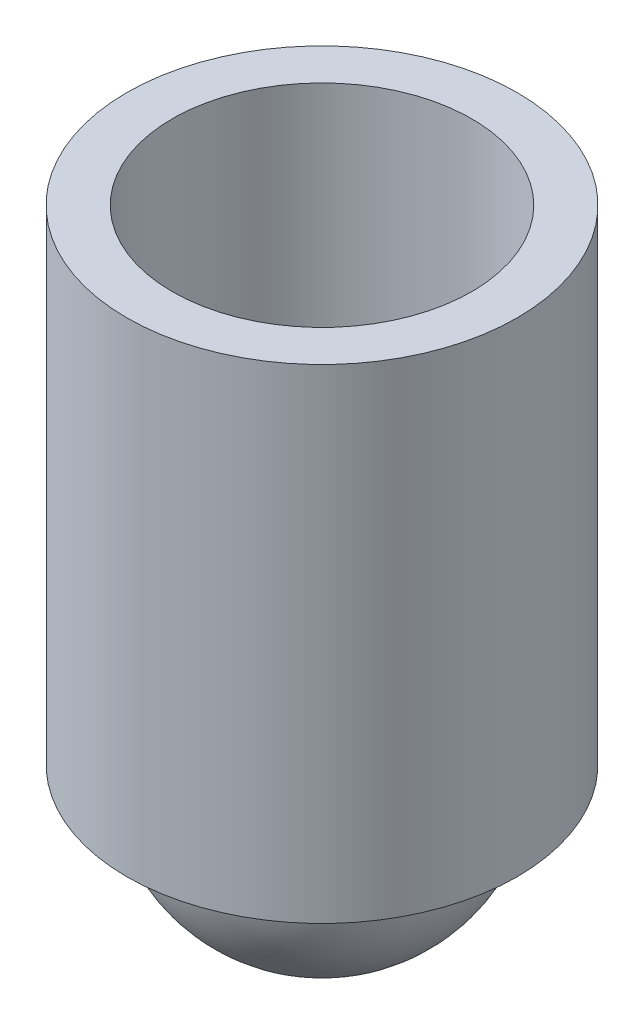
ISO-10303-21;
HEADER;
FILE_DESCRIPTION(('STEP AP214'),'2;1');
FILE_NAME('part.step','',(''),(''),'','','');
FILE_SCHEMA(('AUTOMOTIVE_DESIGN { 1 0 10303 214 1 1 1 1 }'));
ENDSEC;
DATA;
#1=APPLICATION_CONTEXT('core data for automotive mechanical design processes');
#2=APPLICATION_PROTOCOL_DEFINITION('international standard','automotive_design',2000,#1);
#3=PRODUCT_CONTEXT('',#1,'mechanical');
#4=PRODUCT('Part','Part','',(#3));
#5=PRODUCT_RELATED_PRODUCT_CATEGORY('part','',(#4));
#6=PRODUCT_DEFINITION_FORMATION('','',#4);
#7=PRODUCT_DEFINITION_CONTEXT('part definition',#1,'design');
#8=PRODUCT_DEFINITION('design','',#6,#7);
#9=PRODUCT_DEFINITION_SHAPE('','',#8);
#10=(LENGTH_UNIT() NAMED_UNIT(*) SI_UNIT(.MILLI.,.METRE.));
#11=(NAMED_UNIT(*) PLANE_ANGLE_UNIT() SI_UNIT($,.RADIAN.));
#12=(NAMED_UNIT(*) SI_UNIT($,.STERADIAN.) SOLID_ANGLE_UNIT());
#13=UNCERTAINTY_MEASURE_WITH_UNIT(LENGTH_MEASURE(1.E-05),#10,'distance_accuracy_value','');
#14=(GEOMETRIC_REPRESENTATION_CONTEXT(3) GLOBAL_UNCERTAINTY_ASSIGNED_CONTEXT((#13)) GLOBAL_UNIT_ASSIGNED_CONTEXT((#10,
#11,#12)) REPRESENTATION_CONTEXT('',''));
#15=CARTESIAN_POINT('',(0.,0.,0.));
#16=DIRECTION('',(0.,0.,1.));
#17=DIRECTION('',(1.,0.,0.));
#18=AXIS2_PLACEMENT_3D('',#15,#16,#17);
#19=CARTESIAN_POINT('',(0.,-203.2,0.));
#20=DIRECTION('',(0.,1.,0.));
#21=DIRECTION('',(0.,0.,1.));
#22=AXIS2_PLACEMENT_3D('',#19,#20,#21);
#23=PLANE('',#22);
#24=CARTESIAN_POINT('',(0.,-203.2,0.));
#25=DIRECTION('',(0.,1.,0.));
#26=DIRECTION('',(0.,0.,1.));
#27=AXIS2_PLACEMENT_3D('',#24,#25,#26);
#28=CIRCLE('',#27,81.915);
#29=CARTESIAN_POINT('',(0.,-203.2,81.915));
#30=VERTEX_POINT('',#29);
#31=EDGE_CURVE('E39',#30,#30,#28,.T.);
#32=ORIENTED_EDGE('',*,*,#31,.F.);
#33=EDGE_LOOP('',(#32));
#34=FACE_BOUND('',#33,.T.);
#35=CARTESIAN_POINT('',(0.,-203.2,0.));
#36=DIRECTION('',(0.,1.,0.));
#37=DIRECTION('',(0.,0.,1.));
#38=AXIS2_PLACEMENT_3D('',#35,#36,#37);
#39=CIRCLE('',#38,63.5);
#40=CARTESIAN_POINT('',(0.,-203.2,63.5));
#41=VERTEX_POINT('',#40);
#42=EDGE_CURVE('E10',#41,#41,#39,.F.);
#43=ORIENTED_EDGE('',*,*,#42,.F.);
#44=EDGE_LOOP('',(#43));
#45=FACE_BOUND('',#44,.T.);
#46=ADVANCED_FACE('F32',(#34,#45),#23,.F.);
#47=CARTESIAN_POINT('',(0.,-203.2,0.));
#48=DIRECTION('',(0.,1.,0.));
#49=DIRECTION('',(0.,0.,1.));
#50=AXIS2_PLACEMENT_3D('',#47,#48,#49);
#51=CYLINDRICAL_SURFACE('',#50,81.915);
#52=ORIENTED_EDGE('',*,*,#31,.T.);
#53=EDGE_LOOP('',(#52));
#54=FACE_BOUND('',#53,.T.);
#55=CARTESIAN_POINT('',(0.,0.,0.));
#56=DIRECTION('',(0.,1.,0.));
#57=DIRECTION('',(0.,0.,1.));
#58=AXIS2_PLACEMENT_3D('',#55,#56,#57);
#59=CIRCLE('',#58,81.915);
#60=CARTESIAN_POINT('',(0.,0.,81.915));
#61=VERTEX_POINT('',#60);
#62=EDGE_CURVE('E43',#61,#61,#59,.T.);
#63=ORIENTED_EDGE('',*,*,#62,.F.);
#64=EDGE_LOOP('',(#63));
#65=FACE_BOUND('',#64,.T.);
#66=ADVANCED_FACE('F72',(#54,#65),#51,.T.);
#67=CARTESIAN_POINT('',(0.,0.,0.));
#68=DIRECTION('',(0.,1.,0.));
#69=DIRECTION('',(0.,0.,1.));
#70=AXIS2_PLACEMENT_3D('',#67,#68,#69);
#71=PLANE('',#70);
#72=CARTESIAN_POINT('',(0.,0.,0.));
#73=DIRECTION('',(0.,1.,0.));
#74=DIRECTION('',(0.,0.,1.));
#75=AXIS2_PLACEMENT_3D('',#72,#73,#74);
#76=CIRCLE('',#75,62.865);
#77=CARTESIAN_POINT('',(0.,0.,62.865));
#78=VERTEX_POINT('',#77);
#79=EDGE_CURVE('E50',#78,#78,#76,.T.);
#80=ORIENTED_EDGE('',*,*,#79,.F.);
#81=EDGE_LOOP('',(#80));
#82=FACE_BOUND('',#81,.T.);
#83=ORIENTED_EDGE('',*,*,#62,.T.);
#84=EDGE_LOOP('',(#83));
#85=FACE_BOUND('',#84,.T.);
#86=ADVANCED_FACE('F69',(#82,#85),#71,.T.);
#87=CARTESIAN_POINT('',(0.,-203.2,0.));
#88=DIRECTION('',(0.,0.,1.));
#89=DIRECTION('',(1.,0.,0.));
#90=AXIS2_PLACEMENT_3D('',#87,#88,#89);
#91=SPHERICAL_SURFACE('',#90,63.5);
#92=CARTESIAN_POINT('',(0.,-203.2,0.));
#93=DIRECTION('',(0.,1.,0.));
#94=DIRECTION('',(0.,0.,1.));
#95=AXIS2_PLACEMENT_3D('',#92,#93,#94);
#96=SPHERICAL_SURFACE('',#95,63.5);
#97=ORIENTED_EDGE('',*,*,#42,.T.);
#98=EDGE_LOOP('',(#97));
#99=FACE_BOUND('',#98,.T.);
#100=ADVANCED_FACE('F34',(#99),#96,.T.);
#101=CARTESIAN_POINT('',(0.,-184.15,0.));
#102=DIRECTION('',(0.,1.,0.));
#103=DIRECTION('',(0.,0.,1.));
#104=AXIS2_PLACEMENT_3D('',#101,#102,#103);
#105=PLANE('',#104);
#106=CARTESIAN_POINT('',(0.,-184.15,0.));
#107=DIRECTION('',(0.,1.,0.));
#108=DIRECTION('',(0.,0.,1.));
#109=AXIS2_PLACEMENT_3D('',#106,#107,#108);
#110=CIRCLE('',#109,62.865);
#111=CARTESIAN_POINT('',(0.,-184.15,62.865));
#112=VERTEX_POINT('',#111);
#113=EDGE_CURVE('E53',#112,#112,#110,.T.);
#114=ORIENTED_EDGE('',*,*,#113,.T.);
#115=EDGE_LOOP('',(#114));
#116=FACE_BOUND('',#115,.T.);
#117=CARTESIAN_POINT('',(0.,-184.15,0.));
#118=DIRECTION('',(0.,1.,0.));
#119=DIRECTION('',(0.,0.,1.));
#120=AXIS2_PLACEMENT_3D('',#117,#118,#119);
#121=CIRCLE('',#120,40.1609262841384);
#122=CARTESIAN_POINT('',(0.,-184.15,40.1609262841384));
#123=VERTEX_POINT('',#122);
#124=EDGE_CURVE('E48',#123,#123,#121,.F.);
#125=ORIENTED_EDGE('',*,*,#124,.T.);
#126=EDGE_LOOP('',(#125));
#127=FACE_BOUND('',#126,.T.);
#128=ADVANCED_FACE('F59',(#116,#127),#105,.T.);
#129=CARTESIAN_POINT('',(0.,-203.2,0.));
#130=DIRECTION('',(0.,1.,0.));
#131=DIRECTION('',(0.,0.,1.));
#132=AXIS2_PLACEMENT_3D('',#129,#130,#131);
#133=CYLINDRICAL_SURFACE('',#132,62.865);
#134=ORIENTED_EDGE('',*,*,#113,.F.);
#135=EDGE_LOOP('',(#134));
#136=FACE_BOUND('',#135,.T.);
#137=ORIENTED_EDGE('',*,*,#79,.T.);
#138=EDGE_LOOP('',(#137));
#139=FACE_BOUND('',#138,.T.);
#140=ADVANCED_FACE('F62',(#136,#139),#133,.F.);
#141=CARTESIAN_POINT('',(0.,-203.2,0.));
#142=DIRECTION('',(0.,0.,1.));
#143=DIRECTION('',(1.,0.,0.));
#144=AXIS2_PLACEMENT_3D('',#141,#142,#143);
#145=SPHERICAL_SURFACE('',#144,44.45);
#146=CARTESIAN_POINT('',(0.,-203.2,0.));
#147=DIRECTION('',(0.,1.,0.));
#148=DIRECTION('',(0.,0.,1.));
#149=AXIS2_PLACEMENT_3D('',#146,#147,#148);
#150=SPHERICAL_SURFACE('',#149,44.45);
#151=ORIENTED_EDGE('',*,*,#124,.F.);
#152=EDGE_LOOP('',(#151));
#153=FACE_BOUND('',#152,.T.);
#154=ADVANCED_FACE('F65',(#153),#150,.F.);
#155=CLOSED_SHELL('',(#46,#66,#86,#100,#128,#140,#154));
#156=MANIFOLD_SOLID_BREP('B2',#155);
#157=ADVANCED_BREP_SHAPE_REPRESENTATION('',(#18,#156),#14);
#158=SHAPE_DEFINITION_REPRESENTATION(#9,#157);
ENDSEC;
END-ISO-10303-21;
